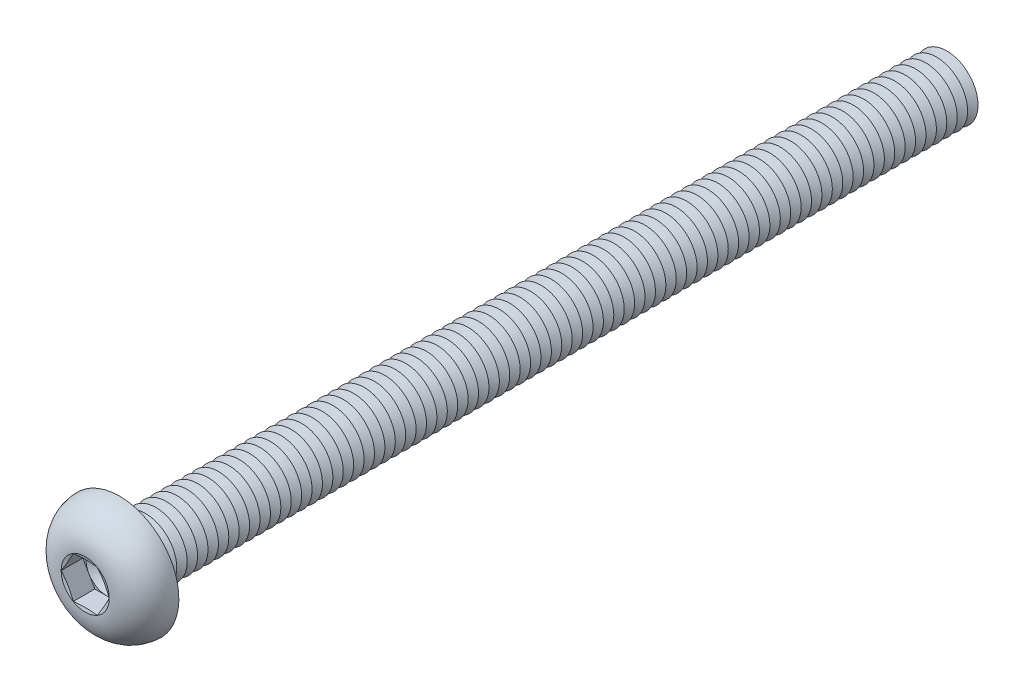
from build123d import *

# Parameters (mm, degrees)
FILLET1_R          = 0.25
LPATTERN1_COUNT    = 80
LPATTERN1_PITCH    = 0.5
CUT_EXTRUDE1_DEPTH = 1.04


with BuildPart() as part:
    # Sketch1 → Revolve1 (revolve)
    with BuildSketch(Plane(origin=(0, 0, 0), x_dir=(0, 0, -1), z_dir=(1, 0, 0))):
        with BuildLine():
            Line((0, 1.5), (0, 2.85))
            ThreePointArc((0, 2.85), (-1.182850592, 2.35063849), (-1.65, 1.1547))
            Line((-1.65, 1.1547), (-1.495299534, 0.57735))
            Line((-1.495299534, 0.57735), (-1.65, 0.57735))
            Line((-1.65, 0.57735), (-1.65, 0))
            Line((-1.65, 0), (40, 0))
            Line((40, 0), (40, 1.5))
            Line((40, 1.5), (0, 1.5))
        make_face()
    revolve(axis=Axis((0, 0, -40), (0, 0, 1)))

    # Fillet1
    fillet1_edges = [part.edges().sort_by_distance(p)[0] for p in [
        (0, -1.5, 0),
    ]]
    fillet(fillet1_edges, radius=FILLET1_R)

    # Sketch2 → Cut-Revolve1 (revolve, cut)
    with BuildSketch(Plane(origin=(0, 0, 0), x_dir=(0, 0, -1), z_dir=(1, 0, 0))):
        Polygon((39.75, 1.5), (40.25, 1.5), (40, 1.066987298), align=None)
    cut_revolve1 = revolve(axis=Axis((0, 0, -40), (0, 0, -1)), mode=Mode.SUBTRACT)

    # LPattern1: Cut-Revolve1 ×80
    with Locations(*[(0, 0, i * LPATTERN1_PITCH) for i in range(1, LPATTERN1_COUNT)]):
        add(cut_revolve1, mode=Mode.SUBTRACT)

    # Sketch3 → Cut-Extrude1 (cut)
    with BuildSketch(Plane.XY.offset(1.65)):
        Polygon((0.57735, 0.999999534), (-0.57735, 0.999999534), (-1.1547, 0), (-0.57735, -0.999999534), (0.57735, -0.999999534), (1.1547, 0), align=None)
    extrude(amount=-CUT_EXTRUDE1_DEPTH, mode=Mode.SUBTRACT)

    # Cut-Extrude2 cone 1 section (on through the dimple's axis) → Cut-Extrude2 (revolve, cut)
    with BuildSketch(Plane(origin=(0, 0, 0.61), x_dir=(0, -1, 0), z_dir=(1, 0, 0))):
        Polygon((0, 0), (0.999999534, 0), (0, 0.57735), align=None)
    revolve(axis=Axis((0, 0, 0.61), (0, 0, -1)), mode=Mode.SUBTRACT)


solid = part.part
